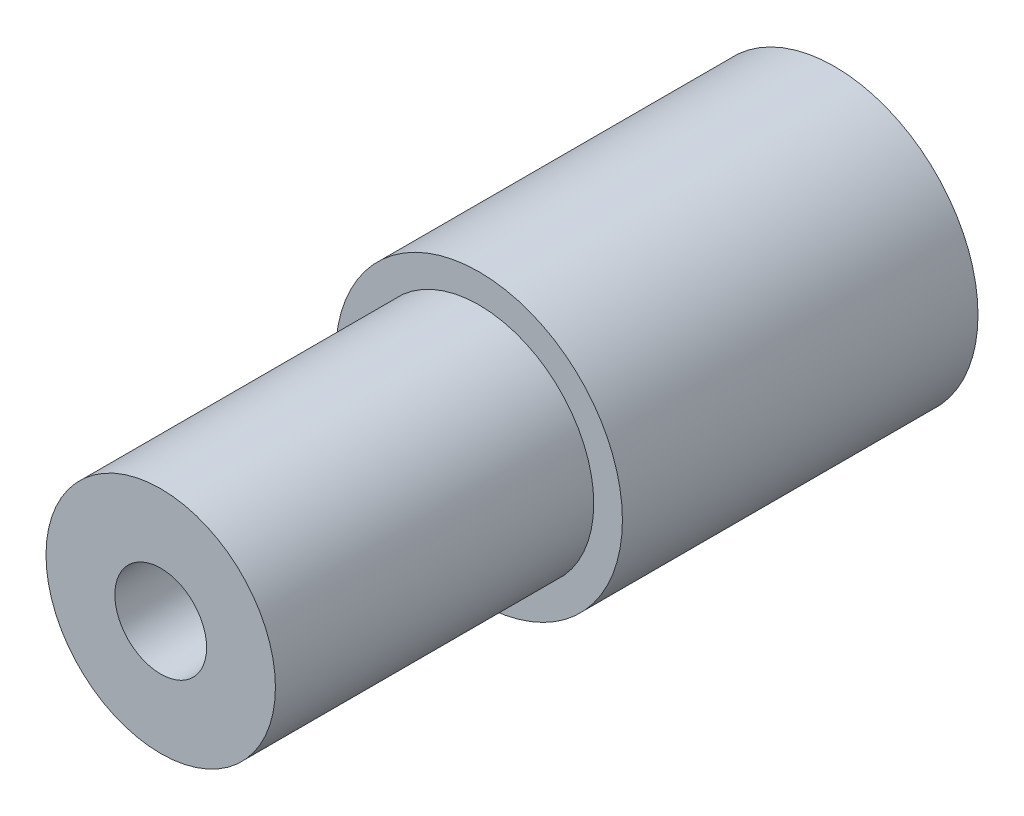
from build123d import *

# Parameters (mm, degrees)
SKETCH2_R           = 4
SKETCH2_R_2         = 1.6
BOSS_EXTRUDE1_DEPTH = 23.5
SKETCH3_R           = 5
SKETCH3_R_2         = 4
BOSS_EXTRUDE2_DEPTH = 12.4


with BuildPart() as part:
    # Sketch2 → Boss-Extrude1 (new body)
    with BuildSketch(Plane.XY):
        Circle(SKETCH2_R)
        Circle(SKETCH2_R_2, mode=Mode.SUBTRACT)
    extrude(amount=BOSS_EXTRUDE1_DEPTH)

    # Sketch3 → Boss-Extrude2 (add)
    with BuildSketch(Plane(origin=(0, 0, 0), x_dir=(-1, 0, 0), z_dir=(0, 0, -1))):
        Circle(SKETCH3_R)
        Circle(SKETCH3_R_2, mode=Mode.SUBTRACT)
    extrude(amount=-BOSS_EXTRUDE2_DEPTH)


solid = part.part
